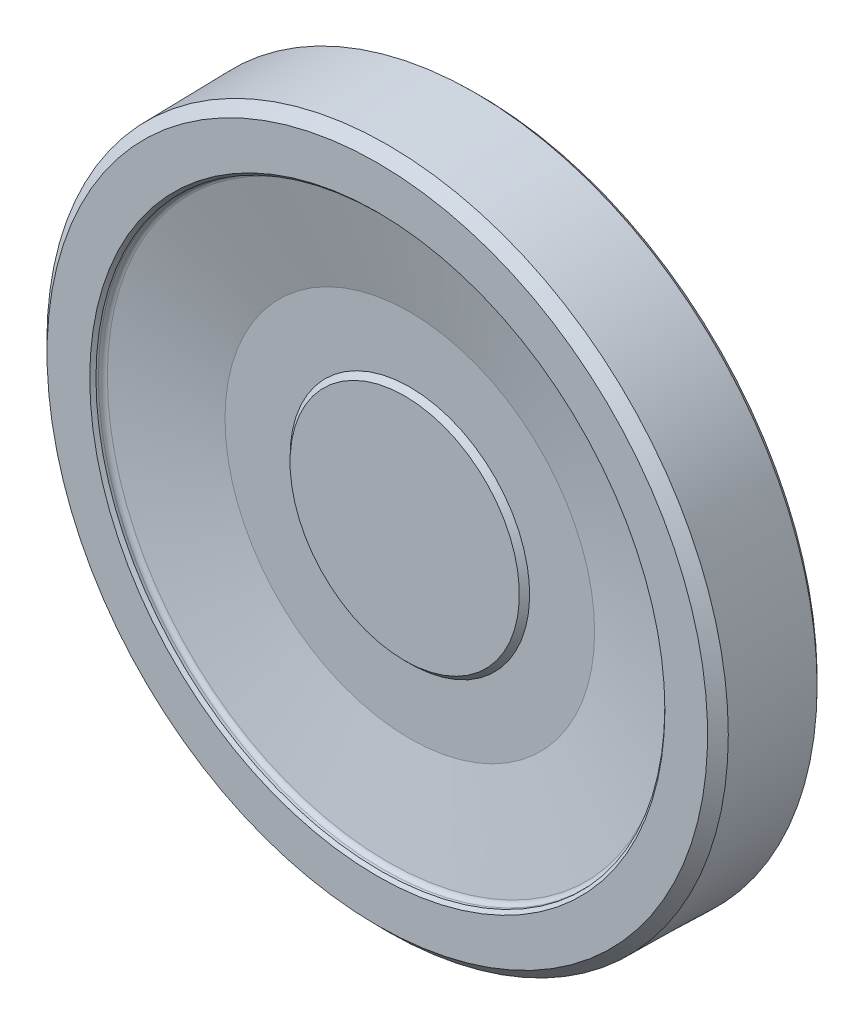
ISO-10303-21;
HEADER;
FILE_DESCRIPTION(('STEP AP214'),'2;1');
FILE_NAME('part.step','',(''),(''),'','','');
FILE_SCHEMA(('AUTOMOTIVE_DESIGN { 1 0 10303 214 1 1 1 1 }'));
ENDSEC;
DATA;
#1=APPLICATION_CONTEXT('core data for automotive mechanical design processes');
#2=APPLICATION_PROTOCOL_DEFINITION('international standard','automotive_design',2000,#1);
#3=PRODUCT_CONTEXT('',#1,'mechanical');
#4=PRODUCT('Part','Part','',(#3));
#5=PRODUCT_RELATED_PRODUCT_CATEGORY('part','',(#4));
#6=PRODUCT_DEFINITION_FORMATION('','',#4);
#7=PRODUCT_DEFINITION_CONTEXT('part definition',#1,'design');
#8=PRODUCT_DEFINITION('design','',#6,#7);
#9=PRODUCT_DEFINITION_SHAPE('','',#8);
#10=(LENGTH_UNIT() NAMED_UNIT(*) SI_UNIT(.MILLI.,.METRE.));
#11=(NAMED_UNIT(*) PLANE_ANGLE_UNIT() SI_UNIT($,.RADIAN.));
#12=(NAMED_UNIT(*) SI_UNIT($,.STERADIAN.) SOLID_ANGLE_UNIT());
#13=UNCERTAINTY_MEASURE_WITH_UNIT(LENGTH_MEASURE(1.E-05),#10,'distance_accuracy_value','');
#14=(GEOMETRIC_REPRESENTATION_CONTEXT(3) GLOBAL_UNCERTAINTY_ASSIGNED_CONTEXT((#13)) GLOBAL_UNIT_ASSIGNED_CONTEXT((#10,
#11,#12)) REPRESENTATION_CONTEXT('',''));
#15=CARTESIAN_POINT('',(0.,0.,0.));
#16=DIRECTION('',(0.,0.,1.));
#17=DIRECTION('',(1.,0.,0.));
#18=AXIS2_PLACEMENT_3D('',#15,#16,#17);
#19=CARTESIAN_POINT('',(0.,0.,36.));
#20=DIRECTION('',(0.,0.,-1.));
#21=DIRECTION('',(0.,1.,0.));
#22=AXIS2_PLACEMENT_3D('',#19,#20,#21);
#23=PLANE('',#22);
#24=CARTESIAN_POINT('',(0.,0.,36.));
#25=DIRECTION('',(0.,0.,-1.));
#26=DIRECTION('',(0.,1.,0.));
#27=AXIS2_PLACEMENT_3D('',#24,#25,#26);
#28=CIRCLE('',#27,16.75);
#29=CARTESIAN_POINT('',(0.,16.75,36.));
#30=VERTEX_POINT('',#29);
#31=EDGE_CURVE('E15',#30,#30,#28,.T.);
#32=ORIENTED_EDGE('',*,*,#31,.F.);
#33=EDGE_LOOP('',(#32));
#34=FACE_BOUND('',#33,.T.);
#35=ADVANCED_FACE('F12',(#34),#23,.F.);
#36=CARTESIAN_POINT('',(0.,0.,35.25));
#37=DIRECTION('',(0.,0.,-1.));
#38=DIRECTION('',(0.,1.,0.));
#39=AXIS2_PLACEMENT_3D('',#36,#37,#38);
#40=CONICAL_SURFACE('',#39,17.5,0.785398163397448);
#41=ORIENTED_EDGE('',*,*,#31,.T.);
#42=EDGE_LOOP('',(#41));
#43=FACE_BOUND('',#42,.T.);
#44=CARTESIAN_POINT('',(0.,0.,35.25));
#45=DIRECTION('',(0.,0.,-1.));
#46=DIRECTION('',(0.,1.,0.));
#47=AXIS2_PLACEMENT_3D('',#44,#45,#46);
#48=CIRCLE('',#47,17.5);
#49=CARTESIAN_POINT('',(0.,17.5,35.25));
#50=VERTEX_POINT('',#49);
#51=EDGE_CURVE('E148',#50,#50,#48,.F.);
#52=ORIENTED_EDGE('',*,*,#51,.T.);
#53=EDGE_LOOP('',(#52));
#54=FACE_BOUND('',#53,.T.);
#55=ADVANCED_FACE('F103',(#43,#54),#40,.T.);
#56=CARTESIAN_POINT('',(17.5,0.,35.25));
#57=DIRECTION('',(0.,0.,-1.));
#58=DIRECTION('',(0.,1.,0.));
#59=AXIS2_PLACEMENT_3D('',#56,#57,#58);
#60=PLANE('',#59);
#61=ORIENTED_EDGE('',*,*,#51,.F.);
#62=EDGE_LOOP('',(#61));
#63=FACE_BOUND('',#62,.T.);
#64=CARTESIAN_POINT('',(0.,0.,35.25));
#65=DIRECTION('',(0.,0.,1.));
#66=DIRECTION('',(0.,-1.,0.));
#67=AXIS2_PLACEMENT_3D('',#64,#65,#66);
#68=CIRCLE('',#67,27.);
#69=CARTESIAN_POINT('',(0.,-27.,35.25));
#70=VERTEX_POINT('',#69);
#71=EDGE_CURVE('E146',#70,#70,#68,.T.);
#72=ORIENTED_EDGE('',*,*,#71,.T.);
#73=EDGE_LOOP('',(#72));
#74=FACE_BOUND('',#73,.T.);
#75=ADVANCED_FACE('F100',(#63,#74),#60,.F.);
#76=CARTESIAN_POINT('',(0.,0.,38.4746550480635));
#77=DIRECTION('',(0.,0.,1.));
#78=DIRECTION('',(0.,-1.,0.));
#79=AXIS2_PLACEMENT_3D('',#76,#77,#78);
#80=CONICAL_SURFACE('',#79,40.9675155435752,1.34390352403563);
#81=ORIENTED_EDGE('',*,*,#71,.F.);
#82=EDGE_LOOP('',(#81));
#83=FACE_BOUND('',#82,.T.);
#84=CARTESIAN_POINT('',(0.,0.,38.4746550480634));
#85=DIRECTION('',(0.,0.,-1.));
#86=DIRECTION('',(0.,1.,0.));
#87=AXIS2_PLACEMENT_3D('',#84,#85,#86);
#88=CIRCLE('',#87,40.9675155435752);
#89=CARTESIAN_POINT('',(0.,40.9675155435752,38.4746550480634));
#90=VERTEX_POINT('',#89);
#91=EDGE_CURVE('E83',#90,#90,#88,.F.);
#92=ORIENTED_EDGE('',*,*,#91,.T.);
#93=EDGE_LOOP('',(#92));
#94=FACE_BOUND('',#93,.T.);
#95=ADVANCED_FACE('F95',(#83,#94),#80,.F.);
#96=CARTESIAN_POINT('',(0.,0.,39.2054325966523));
#97=DIRECTION('',(0.,0.,-1.));
#98=DIRECTION('',(0.,1.,0.));
#99=AXIS2_PLACEMENT_3D('',#96,#97,#98);
#100=TOROIDAL_SURFACE('',#99,40.7988022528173,0.75);
#101=ORIENTED_EDGE('',*,*,#91,.F.);
#102=EDGE_LOOP('',(#101));
#103=FACE_BOUND('',#102,.T.);
#104=CARTESIAN_POINT('',(0.,0.,39.1923432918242));
#105=DIRECTION('',(0.,0.,1.));
#106=DIRECTION('',(0.,-1.,0.));
#107=AXIS2_PLACEMENT_3D('',#104,#105,#106);
#108=CIRCLE('',#107,41.5486880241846);
#109=CARTESIAN_POINT('',(0.,-41.5486880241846,39.1923432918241));
#110=VERTEX_POINT('',#109);
#111=EDGE_CURVE('E78',#110,#110,#108,.T.);
#112=ORIENTED_EDGE('',*,*,#111,.T.);
#113=EDGE_LOOP('',(#112));
#114=FACE_BOUND('',#113,.T.);
#115=ADVANCED_FACE('F90',(#103,#114),#100,.F.);
#116=CARTESIAN_POINT('',(0.,0.,39.5500685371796));
#117=DIRECTION('',(0.,0.,1.));
#118=DIRECTION('',(0.,-1.,0.));
#119=AXIS2_PLACEMENT_3D('',#116,#117,#118);
#120=CONICAL_SURFACE('',#119,41.5549321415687,0.0174532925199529);
#121=ORIENTED_EDGE('',*,*,#111,.F.);
#122=EDGE_LOOP('',(#121));
#123=FACE_BOUND('',#122,.T.);
#124=CARTESIAN_POINT('',(0.,0.,39.5500685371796));
#125=DIRECTION('',(0.,0.,1.));
#126=DIRECTION('',(0.,-1.,0.));
#127=AXIS2_PLACEMENT_3D('',#124,#125,#126);
#128=CIRCLE('',#127,41.5549321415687);
#129=CARTESIAN_POINT('',(0.,-41.5549321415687,39.5500685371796));
#130=VERTEX_POINT('',#129);
#131=EDGE_CURVE('E74',#130,#130,#128,.T.);
#132=ORIENTED_EDGE('',*,*,#131,.T.);
#133=EDGE_LOOP('',(#132));
#134=FACE_BOUND('',#133,.T.);
#135=ADVANCED_FACE('F94',(#123,#134),#120,.F.);
#136=CARTESIAN_POINT('',(0.,0.,40.));
#137=DIRECTION('',(0.,0.,1.));
#138=DIRECTION('',(-1.,0.,0.));
#139=AXIS2_PLACEMENT_3D('',#136,#137,#138);
#140=CONICAL_SURFACE('',#139,42.0127857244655,0.794124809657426);
#141=ORIENTED_EDGE('',*,*,#131,.F.);
#142=EDGE_LOOP('',(#141));
#143=FACE_BOUND('',#142,.T.);
#144=CARTESIAN_POINT('',(0.,0.,40.));
#145=DIRECTION('',(0.,0.,1.));
#146=DIRECTION('',(-1.,0.,0.));
#147=AXIS2_PLACEMENT_3D('',#144,#145,#146);
#148=CIRCLE('',#147,42.0127857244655);
#149=CARTESIAN_POINT('',(-42.0127857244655,0.,40.));
#150=VERTEX_POINT('',#149);
#151=EDGE_CURVE('E77',#150,#150,#148,.T.);
#152=ORIENTED_EDGE('',*,*,#151,.T.);
#153=EDGE_LOOP('',(#152));
#154=FACE_BOUND('',#153,.T.);
#155=ADVANCED_FACE('F162',(#143,#154),#140,.F.);
#156=CARTESIAN_POINT('',(42.0127857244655,0.,40.));
#157=DIRECTION('',(0.,0.,-1.));
#158=DIRECTION('',(0.,1.,0.));
#159=AXIS2_PLACEMENT_3D('',#156,#157,#158);
#160=PLANE('',#159);
#161=ORIENTED_EDGE('',*,*,#151,.F.);
#162=EDGE_LOOP('',(#161));
#163=FACE_BOUND('',#162,.T.);
#164=CARTESIAN_POINT('',(0.,0.,40.));
#165=DIRECTION('',(0.,0.,-1.));
#166=DIRECTION('',(0.,1.,0.));
#167=AXIS2_PLACEMENT_3D('',#164,#165,#166);
#168=CIRCLE('',#167,48.2512653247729);
#169=CARTESIAN_POINT('',(0.,48.2512653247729,40.));
#170=VERTEX_POINT('',#169);
#171=EDGE_CURVE('E141',#170,#170,#168,.T.);
#172=ORIENTED_EDGE('',*,*,#171,.F.);
#173=EDGE_LOOP('',(#172));
#174=FACE_BOUND('',#173,.T.);
#175=ADVANCED_FACE('F167',(#163,#174),#160,.F.);
#176=CARTESIAN_POINT('',(11.4,0.,0.));
#177=DIRECTION('',(0.,0.,1.));
#178=DIRECTION('',(0.,-1.,0.));
#179=AXIS2_PLACEMENT_3D('',#176,#177,#178);
#180=PLANE('',#179);
#181=CARTESIAN_POINT('',(0.,0.,0.));
#182=DIRECTION('',(0.,0.,1.));
#183=DIRECTION('',(-1.,0.,0.));
#184=AXIS2_PLACEMENT_3D('',#181,#182,#183);
#185=CIRCLE('',#184,11.4);
#186=CARTESIAN_POINT('',(-11.4,0.,0.));
#187=VERTEX_POINT('',#186);
#188=EDGE_CURVE('E71',#187,#187,#185,.T.);
#189=ORIENTED_EDGE('',*,*,#188,.F.);
#190=EDGE_LOOP('',(#189));
#191=FACE_BOUND('',#190,.T.);
#192=ADVANCED_FACE('F172',(#191),#180,.F.);
#193=CARTESIAN_POINT('',(0.,0.,38.5002284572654));
#194=DIRECTION('',(0.,0.,-1.));
#195=DIRECTION('',(0.,1.,0.));
#196=AXIS2_PLACEMENT_3D('',#193,#194,#195);
#197=CONICAL_SURFACE('',#196,49.7774439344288,0.794124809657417);
#198=ORIENTED_EDGE('',*,*,#171,.T.);
#199=EDGE_LOOP('',(#198));
#200=FACE_BOUND('',#199,.T.);
#201=CARTESIAN_POINT('',(0.,0.,38.5002284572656));
#202=DIRECTION('',(0.,0.,-1.));
#203=DIRECTION('',(0.,1.,0.));
#204=AXIS2_PLACEMENT_3D('',#201,#202,#203);
#205=CIRCLE('',#204,49.7774439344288);
#206=CARTESIAN_POINT('',(0.,49.7774439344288,38.5002284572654));
#207=VERTEX_POINT('',#206);
#208=EDGE_CURVE('E66',#207,#207,#205,.T.);
#209=ORIENTED_EDGE('',*,*,#208,.F.);
#210=EDGE_LOOP('',(#209));
#211=FACE_BOUND('',#210,.T.);
#212=ADVANCED_FACE('F176',(#200,#211),#197,.T.);
#213=CARTESIAN_POINT('',(0.,0.,0.6));
#214=DIRECTION('',(0.,0.,1.));
#215=DIRECTION('',(-1.,0.,0.));
#216=AXIS2_PLACEMENT_3D('',#213,#214,#215);
#217=CONICAL_SURFACE('',#216,12.,0.785398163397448);
#218=CARTESIAN_POINT('',(0.,0.,0.6));
#219=DIRECTION('',(0.,0.,1.));
#220=DIRECTION('',(0.,-1.,0.));
#221=AXIS2_PLACEMENT_3D('',#218,#219,#220);
#222=CIRCLE('',#221,12.);
#223=CARTESIAN_POINT('',(0.,-12.,0.6));
#224=VERTEX_POINT('',#223);
#225=EDGE_CURVE('E61',#224,#224,#222,.T.);
#226=ORIENTED_EDGE('',*,*,#225,.F.);
#227=EDGE_LOOP('',(#226));
#228=FACE_BOUND('',#227,.T.);
#229=ORIENTED_EDGE('',*,*,#188,.T.);
#230=EDGE_LOOP('',(#229));
#231=FACE_BOUND('',#230,.T.);
#232=ADVANCED_FACE('F179',(#228,#231),#217,.T.);
#233=CARTESIAN_POINT('',(0.,0.,25.7498857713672));
#234=DIRECTION('',(0.,0.,-1.));
#235=DIRECTION('',(0.,1.,0.));
#236=AXIS2_PLACEMENT_3D('',#233,#234,#235);
#237=CONICAL_SURFACE('',#236,50.0000019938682,0.017453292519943);
#238=ORIENTED_EDGE('',*,*,#208,.T.);
#239=EDGE_LOOP('',(#238));
#240=FACE_BOUND('',#239,.T.);
#241=CARTESIAN_POINT('',(0.,0.,25.7498857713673));
#242=DIRECTION('',(0.,0.,1.));
#243=DIRECTION('',(0.,-1.,0.));
#244=AXIS2_PLACEMENT_3D('',#241,#242,#243);
#245=CIRCLE('',#244,50.0000019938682);
#246=CARTESIAN_POINT('',(0.,-50.0000019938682,25.7498857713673));
#247=VERTEX_POINT('',#246);
#248=EDGE_CURVE('E57',#247,#247,#245,.F.);
#249=ORIENTED_EDGE('',*,*,#248,.F.);
#250=EDGE_LOOP('',(#249));
#251=FACE_BOUND('',#250,.T.);
#252=ADVANCED_FACE('F183',(#240,#251),#237,.T.);
#253=CARTESIAN_POINT('',(0.,0.,0.));
#254=DIRECTION('',(0.,0.,1.));
#255=DIRECTION('',(0.,-1.,0.));
#256=AXIS2_PLACEMENT_3D('',#253,#254,#255);
#257=CYLINDRICAL_SURFACE('',#256,12.);
#258=CARTESIAN_POINT('',(0.,0.,12.));
#259=DIRECTION('',(0.,0.,1.));
#260=DIRECTION('',(0.,-1.,0.));
#261=AXIS2_PLACEMENT_3D('',#258,#259,#260);
#262=CIRCLE('',#261,12.);
#263=CARTESIAN_POINT('',(0.,-12.,12.));
#264=VERTEX_POINT('',#263);
#265=EDGE_CURVE('E60',#264,#264,#262,.F.);
#266=ORIENTED_EDGE('',*,*,#265,.T.);
#267=EDGE_LOOP('',(#266));
#268=FACE_BOUND('',#267,.T.);
#269=ORIENTED_EDGE('',*,*,#225,.T.);
#270=EDGE_LOOP('',(#269));
#271=FACE_BOUND('',#270,.T.);
#272=ADVANCED_FACE('F186',(#268,#271),#257,.T.);
#273=CARTESIAN_POINT('',(0.,0.,25.7498857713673));
#274=DIRECTION('',(0.,0.,1.));
#275=DIRECTION('',(0.,-1.,0.));
#276=AXIS2_PLACEMENT_3D('',#273,#274,#275);
#277=CONICAL_SURFACE('',#276,50.0000019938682,0.776671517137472);
#278=ORIENTED_EDGE('',*,*,#248,.T.);
#279=EDGE_LOOP('',(#278));
#280=FACE_BOUND('',#279,.T.);
#281=CARTESIAN_POINT('',(0.,0.,25.));
#282=DIRECTION('',(0.,0.,1.));
#283=DIRECTION('',(0.,-1.,0.));
#284=AXIS2_PLACEMENT_3D('',#281,#282,#283);
#285=CIRCLE('',#284,49.2630912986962);
#286=CARTESIAN_POINT('',(0.,-49.2630912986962,25.));
#287=VERTEX_POINT('',#286);
#288=EDGE_CURVE('E130',#287,#287,#285,.T.);
#289=ORIENTED_EDGE('',*,*,#288,.T.);
#290=EDGE_LOOP('',(#289));
#291=FACE_BOUND('',#290,.T.);
#292=ADVANCED_FACE('F190',(#280,#291),#277,.T.);
#293=CARTESIAN_POINT('',(19.5,0.,12.));
#294=DIRECTION('',(0.,0.,1.));
#295=DIRECTION('',(0.,-1.,0.));
#296=AXIS2_PLACEMENT_3D('',#293,#294,#295);
#297=PLANE('',#296);
#298=CARTESIAN_POINT('',(0.,0.,12.));
#299=DIRECTION('',(0.,0.,1.));
#300=DIRECTION('',(0.,-1.,0.));
#301=AXIS2_PLACEMENT_3D('',#298,#299,#300);
#302=CIRCLE('',#301,19.5);
#303=CARTESIAN_POINT('',(0.,-19.5,12.));
#304=VERTEX_POINT('',#303);
#305=EDGE_CURVE('E128',#304,#304,#302,.T.);
#306=ORIENTED_EDGE('',*,*,#305,.F.);
#307=EDGE_LOOP('',(#306));
#308=FACE_BOUND('',#307,.T.);
#309=ORIENTED_EDGE('',*,*,#265,.F.);
#310=EDGE_LOOP('',(#309));
#311=FACE_BOUND('',#310,.T.);
#312=ADVANCED_FACE('F193',(#308,#311),#297,.F.);
#313=CARTESIAN_POINT('',(49.2630912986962,0.,25.));
#314=DIRECTION('',(0.,0.,1.));
#315=DIRECTION('',(0.,-1.,0.));
#316=AXIS2_PLACEMENT_3D('',#313,#314,#315);
#317=PLANE('',#316);
#318=ORIENTED_EDGE('',*,*,#288,.F.);
#319=EDGE_LOOP('',(#318));
#320=FACE_BOUND('',#319,.T.);
#321=CARTESIAN_POINT('',(0.,0.,25.));
#322=DIRECTION('',(0.,0.,1.));
#323=DIRECTION('',(0.,-1.,0.));
#324=AXIS2_PLACEMENT_3D('',#321,#322,#323);
#325=CIRCLE('',#324,41.5384615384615);
#326=CARTESIAN_POINT('',(0.,-41.5384615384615,25.));
#327=VERTEX_POINT('',#326);
#328=EDGE_CURVE('E54',#327,#327,#325,.T.);
#329=ORIENTED_EDGE('',*,*,#328,.T.);
#330=EDGE_LOOP('',(#329));
#331=FACE_BOUND('',#330,.T.);
#332=ADVANCED_FACE('F125',(#320,#331),#317,.F.);
#333=CARTESIAN_POINT('',(0.,0.,0.));
#334=DIRECTION('',(0.,0.,1.));
#335=DIRECTION('',(0.,-1.,0.));
#336=AXIS2_PLACEMENT_3D('',#333,#334,#335);
#337=CYLINDRICAL_SURFACE('',#336,19.5);
#338=CARTESIAN_POINT('',(0.,0.,18.6283446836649));
#339=DIRECTION('',(0.,0.,-1.));
#340=DIRECTION('',(0.,1.,0.));
#341=AXIS2_PLACEMENT_3D('',#338,#339,#340);
#342=CIRCLE('',#341,19.5);
#343=CARTESIAN_POINT('',(0.,19.5,18.6283446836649));
#344=VERTEX_POINT('',#343);
#345=EDGE_CURVE('E51',#344,#344,#342,.T.);
#346=ORIENTED_EDGE('',*,*,#345,.T.);
#347=EDGE_LOOP('',(#346));
#348=FACE_BOUND('',#347,.T.);
#349=ORIENTED_EDGE('',*,*,#305,.T.);
#350=EDGE_LOOP('',(#349));
#351=FACE_BOUND('',#350,.T.);
#352=ADVANCED_FACE('F122',(#348,#351),#337,.T.);
#353=CARTESIAN_POINT('',(0.,0.,0.));
#354=DIRECTION('',(0.,0.,1.));
#355=DIRECTION('',(0.,-1.,0.));
#356=AXIS2_PLACEMENT_3D('',#353,#354,#355);
#357=CYLINDRICAL_SURFACE('',#356,41.5384615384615);
#358=ORIENTED_EDGE('',*,*,#328,.F.);
#359=EDGE_LOOP('',(#358));
#360=FACE_BOUND('',#359,.T.);
#361=CARTESIAN_POINT('',(0.,0.,26.6288889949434));
#362=DIRECTION('',(0.,0.,-1.));
#363=DIRECTION('',(0.,1.,0.));
#364=AXIS2_PLACEMENT_3D('',#361,#362,#363);
#365=CIRCLE('',#364,41.5384615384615);
#366=CARTESIAN_POINT('',(0.,41.5384615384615,26.6288889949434));
#367=VERTEX_POINT('',#366);
#368=EDGE_CURVE('E24',#367,#367,#365,.F.);
#369=ORIENTED_EDGE('',*,*,#368,.T.);
#370=EDGE_LOOP('',(#369));
#371=FACE_BOUND('',#370,.T.);
#372=ADVANCED_FACE('F45',(#360,#371),#357,.F.);
#373=CARTESIAN_POINT('',(0.,0.,18.6283446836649));
#374=DIRECTION('',(0.,0.,-1.));
#375=DIRECTION('',(0.,1.,0.));
#376=AXIS2_PLACEMENT_3D('',#373,#374,#375);
#377=TOROIDAL_SURFACE('',#376,21.,1.5);
#378=CARTESIAN_POINT('',(0.,0.,20.0378836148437));
#379=DIRECTION('',(0.,0.,1.));
#380=DIRECTION('',(0.,-1.,0.));
#381=AXIS2_PLACEMENT_3D('',#378,#379,#380);
#382=CIRCLE('',#381,20.4869697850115);
#383=CARTESIAN_POINT('',(0.,-20.4869697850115,20.0378836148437));
#384=VERTEX_POINT('',#383);
#385=EDGE_CURVE('E19',#384,#384,#382,.T.);
#386=ORIENTED_EDGE('',*,*,#385,.F.);
#387=EDGE_LOOP('',(#386));
#388=FACE_BOUND('',#387,.T.);
#389=ORIENTED_EDGE('',*,*,#345,.F.);
#390=EDGE_LOOP('',(#389));
#391=FACE_BOUND('',#390,.T.);
#392=ADVANCED_FACE('F40',(#388,#391),#377,.F.);
#393=CARTESIAN_POINT('',(0.,0.,26.6288889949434));
#394=DIRECTION('',(0.,0.,-1.));
#395=DIRECTION('',(0.,1.,0.));
#396=AXIS2_PLACEMENT_3D('',#393,#394,#395);
#397=TOROIDAL_SURFACE('',#396,40.7884615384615,0.75);
#398=ORIENTED_EDGE('',*,*,#368,.F.);
#399=EDGE_LOOP('',(#398));
#400=FACE_BOUND('',#399,.T.);
#401=CARTESIAN_POINT('',(0.,0.,27.3336584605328));
#402=DIRECTION('',(0.,0.,1.));
#403=DIRECTION('',(0.,-1.,0.));
#404=AXIS2_PLACEMENT_3D('',#401,#402,#403);
#405=CIRCLE('',#404,40.5319464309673);
#406=CARTESIAN_POINT('',(0.,-40.5319464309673,27.3336584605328));
#407=VERTEX_POINT('',#406);
#408=EDGE_CURVE('E8',#407,#407,#405,.F.);
#409=ORIENTED_EDGE('',*,*,#408,.F.);
#410=EDGE_LOOP('',(#409));
#411=FACE_BOUND('',#410,.T.);
#412=ADVANCED_FACE('F35',(#400,#411),#397,.F.);
#413=CARTESIAN_POINT('',(0.,0.,27.3336584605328));
#414=DIRECTION('',(0.,0.,1.));
#415=DIRECTION('',(0.,-1.,0.));
#416=AXIS2_PLACEMENT_3D('',#413,#414,#415);
#417=CONICAL_SURFACE('',#416,40.5319464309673,1.22173047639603);
#418=ORIENTED_EDGE('',*,*,#408,.T.);
#419=EDGE_LOOP('',(#418));
#420=FACE_BOUND('',#419,.T.);
#421=ORIENTED_EDGE('',*,*,#385,.T.);
#422=EDGE_LOOP('',(#421));
#423=FACE_BOUND('',#422,.T.);
#424=ADVANCED_FACE('F39',(#420,#423),#417,.T.);
#425=CLOSED_SHELL('',(#35,#55,#75,#95,#115,#135,#155,#175,#192,#212,#232,#252,#272,#292,#312,
#332,#352,#372,#392,#412,#424));
#426=MANIFOLD_SOLID_BREP('B1',#425);
#427=ADVANCED_BREP_SHAPE_REPRESENTATION('',(#18,#426),#14);
#428=SHAPE_DEFINITION_REPRESENTATION(#9,#427);
ENDSEC;
END-ISO-10303-21;
